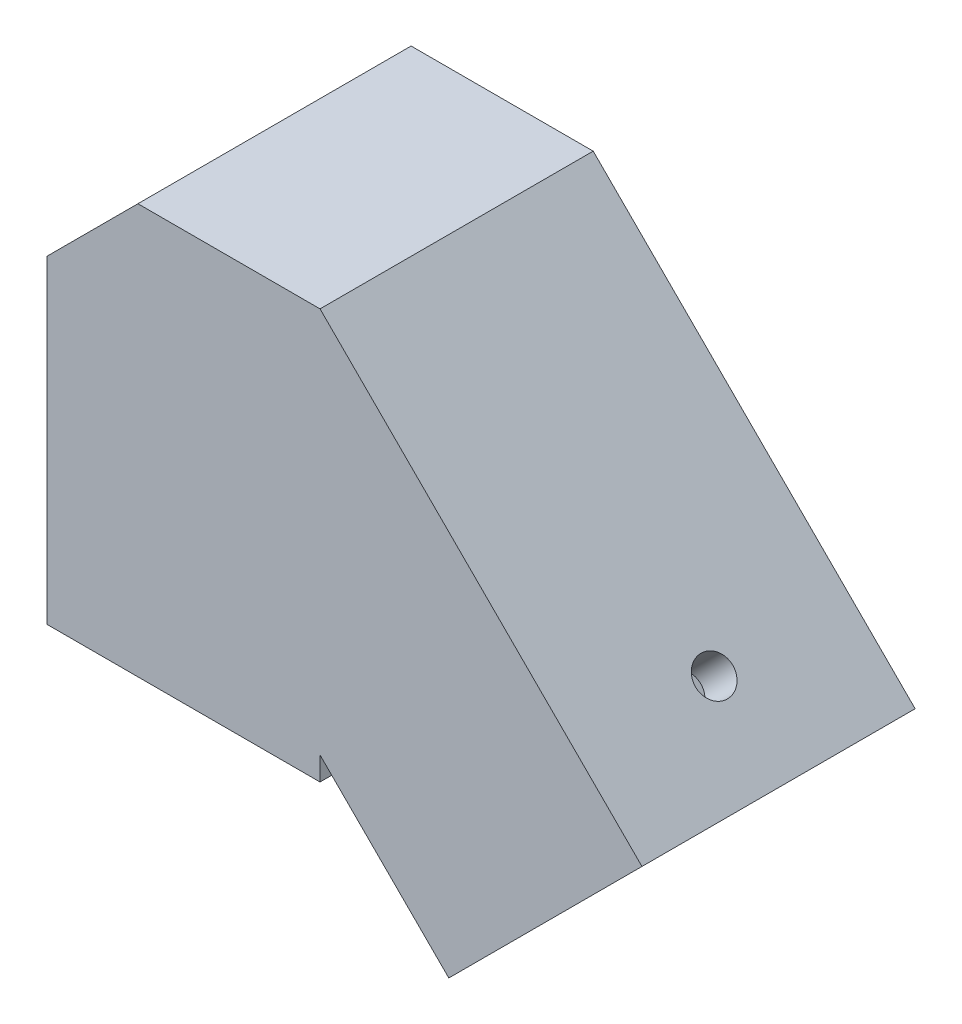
from build123d import *

# Parameters (mm, degrees)
SALIENTE_EXTRUIR1_DEPTH      = 20
SALIENTE_EXTRUIR1_DEPTH_BACK = 25
CROQUIS2_W                   = 30
CROQUIS2_H                   = 30
SALIENTE_EXTRUIR2_DEPTH      = 30
CROQUIS4_W                   = 20.05
CROQUIS4_H                   = 20.05
CORTAR_EXTRUIR1_DEPTH        = 20
CROQUIS5_W                   = 20.05
CROQUIS5_H                   = 20.05
CORTAR_EXTRUIR2_DEPTH        = 25
CHAFL_N1_SIZE                = 10
CROQUIS6_R                   = 2.05
CORTAR_EXTRUIR3_DEPTH        = 4.975
CROQUIS7_R                   = 2.05
CORTAR_EXTRUIR4_DEPTH        = 4.975


with BuildPart() as part:
    # Croquis2 → Saliente-Extruir1 (new, two sides: drawn at the far end of the back side and taken through both)
    with BuildSketch(Plane(origin=(0, 0, 0), x_dir=(1, 0, 0), z_dir=(0, 1, 0)).offset(-SALIENTE_EXTRUIR1_DEPTH_BACK)):
        Rectangle(CROQUIS2_W, CROQUIS2_H)
    extrude(amount=SALIENTE_EXTRUIR1_DEPTH + SALIENTE_EXTRUIR1_DEPTH_BACK)

    # Croquis3 → Saliente-Extruir2 (add)
    with BuildSketch(Plane.XY.offset(15)):
        Polygon((15, 20), (50.355339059, -15.355339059), (29.142135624, -36.568542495), (15, -22.426406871), align=None)
    extrude(amount=-SALIENTE_EXTRUIR2_DEPTH)

    # Croquis4 → Cortar-Extruir1 (cut)
    with BuildSketch(Plane.XZ.offset(25)):
        Rectangle(CROQUIS4_W, CROQUIS4_H)
    extrude(amount=-CORTAR_EXTRUIR1_DEPTH, mode=Mode.SUBTRACT)

    # Croquis5 → Cortar-Extruir2 (cut)
    with BuildSketch(Plane(origin=(32.855339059, -32.855339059, 0), x_dir=(0, 0, -1), z_dir=(0.7071067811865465, -0.7071067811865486, 0))):
        with Locations((0, 9.748737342)):
            Rectangle(CROQUIS5_W, CROQUIS5_H)
    extrude(amount=-CORTAR_EXTRUIR2_DEPTH, mode=Mode.SUBTRACT)

    # Chafl_n1
    chafl_n1_edges = [part.edges().sort_by_distance(p)[0] for p in [
        (-15, 20, 0),
    ]]
    chamfer(chafl_n1_edges, length=CHAFL_N1_SIZE)

    # Croquis6 → Cortar-Extruir3 (cut)
    with BuildSketch(Plane(origin=(17.5, 17.5, 0), x_dir=(0, 0, -1), z_dir=(0.7071067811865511, 0.707106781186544, 0))):
        with Locations(Location((0, -36.464466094, 0), (0, 0, 90))):
            Circle(CROQUIS6_R)
    extrude(amount=-CORTAR_EXTRUIR3_DEPTH, mode=Mode.SUBTRACT)

    # Croquis7 → Cortar-Extruir4 (cut)
    with BuildSketch(Plane.ZY.offset(15)):
        with Locations((0, -15)):
            Circle(CROQUIS7_R)
    extrude(amount=-CORTAR_EXTRUIR4_DEPTH, mode=Mode.SUBTRACT)


solid = part.part
